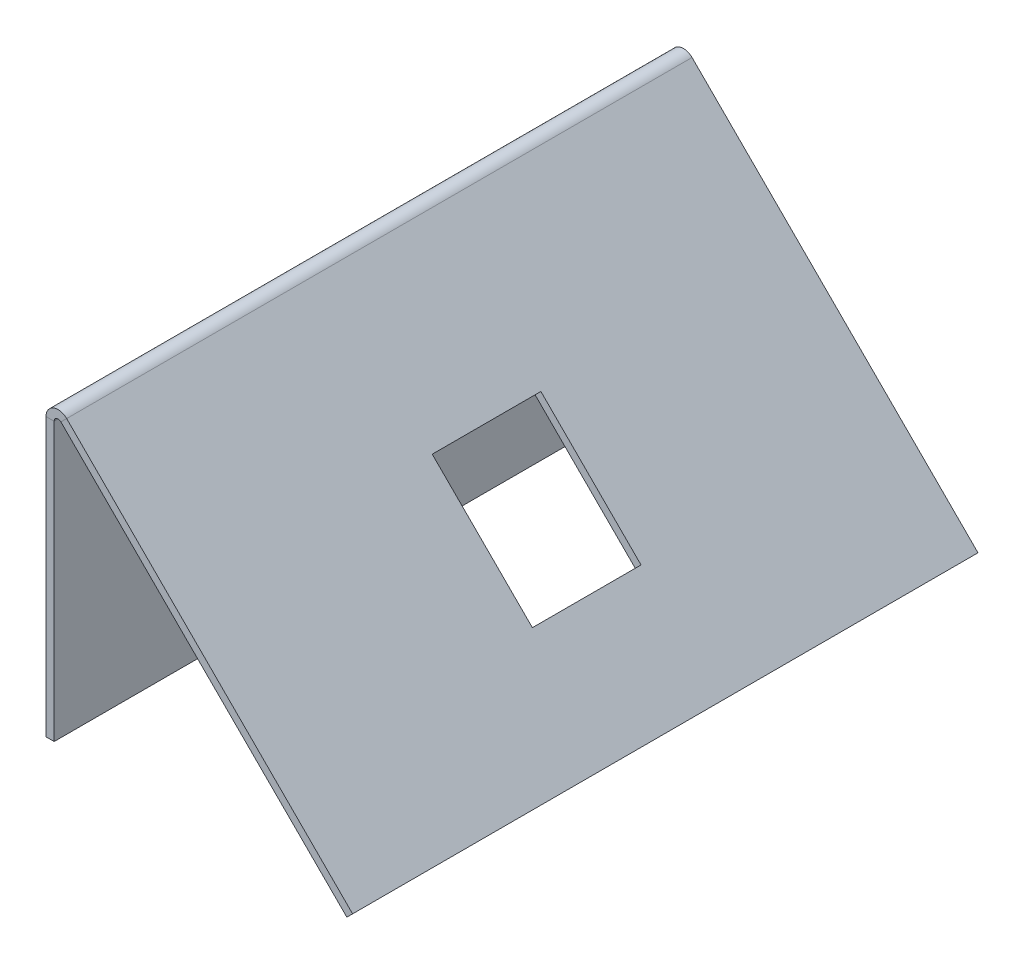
ISO-10303-21;
HEADER;
FILE_DESCRIPTION(('STEP AP214'),'2;1');
FILE_NAME('part.step','',(''),(''),'','','');
FILE_SCHEMA(('AUTOMOTIVE_DESIGN { 1 0 10303 214 1 1 1 1 }'));
ENDSEC;
DATA;
#1=APPLICATION_CONTEXT('core data for automotive mechanical design processes');
#2=APPLICATION_PROTOCOL_DEFINITION('international standard','automotive_design',2000,#1);
#3=PRODUCT_CONTEXT('',#1,'mechanical');
#4=PRODUCT('Part','Part','',(#3));
#5=PRODUCT_RELATED_PRODUCT_CATEGORY('part','',(#4));
#6=PRODUCT_DEFINITION_FORMATION('','',#4);
#7=PRODUCT_DEFINITION_CONTEXT('part definition',#1,'design');
#8=PRODUCT_DEFINITION('design','',#6,#7);
#9=PRODUCT_DEFINITION_SHAPE('','',#8);
#10=(LENGTH_UNIT() NAMED_UNIT(*) SI_UNIT(.MILLI.,.METRE.));
#11=(NAMED_UNIT(*) PLANE_ANGLE_UNIT() SI_UNIT($,.RADIAN.));
#12=(NAMED_UNIT(*) SI_UNIT($,.STERADIAN.) SOLID_ANGLE_UNIT());
#13=UNCERTAINTY_MEASURE_WITH_UNIT(LENGTH_MEASURE(1.E-05),#10,'distance_accuracy_value','');
#14=(GEOMETRIC_REPRESENTATION_CONTEXT(3) GLOBAL_UNCERTAINTY_ASSIGNED_CONTEXT((#13)) GLOBAL_UNIT_ASSIGNED_CONTEXT((#10,
#11,#12)) REPRESENTATION_CONTEXT('',''));
#15=CARTESIAN_POINT('',(0.,0.,0.));
#16=DIRECTION('',(0.,0.,1.));
#17=DIRECTION('',(1.,0.,0.));
#18=AXIS2_PLACEMENT_3D('',#15,#16,#17);
#19=CARTESIAN_POINT('',(-1.0776307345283,56.2074154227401,-116.84));
#20=DIRECTION('',(-0.707106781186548,-0.707106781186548,0.));
#21=DIRECTION('',(0.707106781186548,-0.707106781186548,0.));
#22=AXIS2_PLACEMENT_3D('',#19,#20,#21);
#23=PLANE('',#22);
#24=DIRECTION('',(0.707106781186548,-0.707106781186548,0.));
#25=VECTOR('',#24,1.);
#26=CARTESIAN_POINT('',(-1.0776307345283,56.2074154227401,0.));
#27=LINE('',#26,#25);
#28=CARTESIAN_POINT('',(2.78145485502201,52.3483298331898,0.));
#29=VERTEX_POINT('',#28);
#30=CARTESIAN_POINT('',(56.2074154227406,-1.0776307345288,0.));
#31=VERTEX_POINT('',#30);
#32=EDGE_CURVE('E215',#29,#31,#27,.T.);
#33=ORIENTED_EDGE('',*,*,#32,.F.);
#34=DIRECTION('',(0.,0.,1.));
#35=VECTOR('',#34,1.);
#36=CARTESIAN_POINT('',(2.78145485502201,52.3483298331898,-116.84));
#37=LINE('',#36,#35);
#38=CARTESIAN_POINT('',(2.78145485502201,52.3483298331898,-116.84));
#39=VERTEX_POINT('',#38);
#40=EDGE_CURVE('E261',#39,#29,#37,.T.);
#41=ORIENTED_EDGE('',*,*,#40,.F.);
#42=DIRECTION('',(0.707106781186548,-0.707106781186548,0.));
#43=VECTOR('',#42,1.);
#44=CARTESIAN_POINT('',(-1.0776307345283,56.2074154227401,-116.84));
#45=LINE('',#44,#43);
#46=CARTESIAN_POINT('',(56.2074154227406,-1.0776307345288,-116.84));
#47=VERTEX_POINT('',#46);
#48=EDGE_CURVE('E239',#39,#47,#45,.T.);
#49=ORIENTED_EDGE('',*,*,#48,.T.);
#50=DIRECTION('',(0.,0.,1.));
#51=VECTOR('',#50,1.);
#52=CARTESIAN_POINT('',(56.2074154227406,-1.0776307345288,-116.84));
#53=LINE('',#52,#51);
#54=EDGE_CURVE('E260',#47,#31,#53,.T.);
#55=ORIENTED_EDGE('',*,*,#54,.T.);
#56=EDGE_LOOP('',(#33,#41,#49,#55));
#57=FACE_BOUND('',#56,.T.);
#58=DIRECTION('',(0.,0.,-1.));
#59=VECTOR('',#58,1.);
#60=CARTESIAN_POINT('',(22.7395936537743,32.3901910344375,-116.84));
#61=LINE('',#60,#59);
#62=CARTESIAN_POINT('',(22.7395936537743,32.3901910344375,-48.3420996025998));
#63=VERTEX_POINT('',#62);
#64=CARTESIAN_POINT('',(22.7395936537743,32.3901910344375,-68.6406378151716));
#65=VERTEX_POINT('',#64);
#66=EDGE_CURVE('E172',#63,#65,#61,.T.);
#67=ORIENTED_EDGE('',*,*,#66,.F.);
#68=DIRECTION('',(-0.707106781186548,0.707106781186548,0.));
#69=VECTOR('',#68,1.);
#70=CARTESIAN_POINT('',(-1.0776307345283,56.2074154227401,-48.3420996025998));
#71=LINE('',#70,#69);
#72=CARTESIAN_POINT('',(41.45104501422,13.6787396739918,-48.3420996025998));
#73=VERTEX_POINT('',#72);
#74=EDGE_CURVE('E175',#73,#63,#71,.T.);
#75=ORIENTED_EDGE('',*,*,#74,.F.);
#76=DIRECTION('',(0.,0.,1.));
#77=VECTOR('',#76,1.);
#78=CARTESIAN_POINT('',(41.45104501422,13.6787396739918,-116.84));
#79=LINE('',#78,#77);
#80=CARTESIAN_POINT('',(41.45104501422,13.6787396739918,-68.6406378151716));
#81=VERTEX_POINT('',#80);
#82=EDGE_CURVE('E157',#81,#73,#79,.T.);
#83=ORIENTED_EDGE('',*,*,#82,.F.);
#84=DIRECTION('',(0.707106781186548,-0.707106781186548,0.));
#85=VECTOR('',#84,1.);
#86=CARTESIAN_POINT('',(-1.0776307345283,56.2074154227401,-68.6406378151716));
#87=LINE('',#86,#85);
#88=EDGE_CURVE('E165',#65,#81,#87,.T.);
#89=ORIENTED_EDGE('',*,*,#88,.F.);
#90=EDGE_LOOP('',(#67,#75,#83,#89));
#91=FACE_BOUND('',#90,.T.);
#92=ADVANCED_FACE('F43',(#57,#91),#23,.T.);
#93=CARTESIAN_POINT('',(0.,57.2850461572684,-116.84));
#94=DIRECTION('',(-0.707106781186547,-0.707106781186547,0.));
#95=DIRECTION('',(0.707106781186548,-0.707106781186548,0.));
#96=AXIS2_PLACEMENT_3D('',#93,#94,#95);
#97=PLANE('',#96);
#98=DIRECTION('',(0.707106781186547,-0.707106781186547,0.));
#99=VECTOR('',#98,1.);
#100=CARTESIAN_POINT('',(0.,57.2850461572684,0.));
#101=LINE('',#100,#99);
#102=CARTESIAN_POINT('',(3.85908558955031,53.4259605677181,0.));
#103=VERTEX_POINT('',#102);
#104=CARTESIAN_POINT('',(57.2850461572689,-5.00358550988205E-13,0.));
#105=VERTEX_POINT('',#104);
#106=EDGE_CURVE('E223',#103,#105,#101,.T.);
#107=ORIENTED_EDGE('',*,*,#106,.T.);
#108=DIRECTION('',(0.,0.,1.));
#109=VECTOR('',#108,1.);
#110=CARTESIAN_POINT('',(57.2850461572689,-5.00358550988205E-13,-116.84));
#111=LINE('',#110,#109);
#112=CARTESIAN_POINT('',(57.2850461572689,-5.00358550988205E-13,-116.84));
#113=VERTEX_POINT('',#112);
#114=EDGE_CURVE('E279',#113,#105,#111,.T.);
#115=ORIENTED_EDGE('',*,*,#114,.F.);
#116=DIRECTION('',(0.707106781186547,-0.707106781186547,0.));
#117=VECTOR('',#116,1.);
#118=CARTESIAN_POINT('',(0.,57.2850461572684,-116.84));
#119=LINE('',#118,#117);
#120=CARTESIAN_POINT('',(3.85908558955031,53.4259605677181,-116.84));
#121=VERTEX_POINT('',#120);
#122=EDGE_CURVE('E244',#121,#113,#119,.T.);
#123=ORIENTED_EDGE('',*,*,#122,.F.);
#124=DIRECTION('',(0.,0.,1.));
#125=VECTOR('',#124,1.);
#126=CARTESIAN_POINT('',(3.85908558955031,53.4259605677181,-116.84));
#127=LINE('',#126,#125);
#128=EDGE_CURVE('E276',#121,#103,#127,.T.);
#129=ORIENTED_EDGE('',*,*,#128,.T.);
#130=EDGE_LOOP('',(#107,#115,#123,#129));
#131=FACE_BOUND('',#130,.T.);
#132=DIRECTION('',(0.707106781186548,-0.707106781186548,0.));
#133=VECTOR('',#132,1.);
#134=CARTESIAN_POINT('',(0.,57.2850461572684,-48.3420996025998));
#135=LINE('',#134,#133);
#136=CARTESIAN_POINT('',(42.5286757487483,14.7563704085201,-48.3420996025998));
#137=VERTEX_POINT('',#136);
#138=CARTESIAN_POINT('',(23.8172243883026,33.4678217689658,-48.3420996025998));
#139=VERTEX_POINT('',#138);
#140=EDGE_CURVE('E171',#137,#139,#135,.F.);
#141=ORIENTED_EDGE('',*,*,#140,.T.);
#142=DIRECTION('',(0.,0.,1.));
#143=VECTOR('',#142,1.);
#144=CARTESIAN_POINT('',(23.8172243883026,33.4678217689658,-116.84));
#145=LINE('',#144,#143);
#146=CARTESIAN_POINT('',(23.8172243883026,33.4678217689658,-68.6406378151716));
#147=VERTEX_POINT('',#146);
#148=EDGE_CURVE('E170',#139,#147,#145,.F.);
#149=ORIENTED_EDGE('',*,*,#148,.T.);
#150=DIRECTION('',(0.707106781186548,-0.707106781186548,0.));
#151=VECTOR('',#150,1.);
#152=CARTESIAN_POINT('',(0.,57.2850461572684,-68.6406378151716));
#153=LINE('',#152,#151);
#154=CARTESIAN_POINT('',(42.5286757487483,14.7563704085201,-68.6406378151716));
#155=VERTEX_POINT('',#154);
#156=EDGE_CURVE('E162',#147,#155,#153,.T.);
#157=ORIENTED_EDGE('',*,*,#156,.T.);
#158=DIRECTION('',(0.,0.,1.));
#159=VECTOR('',#158,1.);
#160=CARTESIAN_POINT('',(42.5286757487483,14.7563704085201,-116.84));
#161=LINE('',#160,#159);
#162=EDGE_CURVE('E152',#155,#137,#161,.T.);
#163=ORIENTED_EDGE('',*,*,#162,.T.);
#164=EDGE_LOOP('',(#141,#149,#157,#163));
#165=FACE_BOUND('',#164,.T.);
#166=ADVANCED_FACE('F169',(#131,#165),#97,.F.);
#167=CARTESIAN_POINT('',(1.524,0.,-116.84));
#168=DIRECTION('',(1.,0.,0.));
#169=DIRECTION('',(0.,0.,-1.));
#170=AXIS2_PLACEMENT_3D('',#167,#168,#169);
#171=PLANE('',#170);
#172=DIRECTION('',(0.,1.,0.));
#173=VECTOR('',#172,1.);
#174=CARTESIAN_POINT('',(1.524,0.,0.));
#175=LINE('',#174,#173);
#176=CARTESIAN_POINT('',(1.524,0.,0.));
#177=VERTEX_POINT('',#176);
#178=CARTESIAN_POINT('',(1.524,51.8274749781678,0.));
#179=VERTEX_POINT('',#178);
#180=EDGE_CURVE('E233',#177,#179,#175,.T.);
#181=ORIENTED_EDGE('',*,*,#180,.F.);
#182=DIRECTION('',(0.,0.,1.));
#183=VECTOR('',#182,1.);
#184=CARTESIAN_POINT('',(1.524,0.,-116.84));
#185=LINE('',#184,#183);
#186=CARTESIAN_POINT('',(1.524,0.,-116.84));
#187=VERTEX_POINT('',#186);
#188=EDGE_CURVE('E268',#187,#177,#185,.T.);
#189=ORIENTED_EDGE('',*,*,#188,.F.);
#190=DIRECTION('',(0.,1.,0.));
#191=VECTOR('',#190,1.);
#192=CARTESIAN_POINT('',(1.524,0.,-116.84));
#193=LINE('',#192,#191);
#194=CARTESIAN_POINT('',(1.524,51.8274749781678,-116.84));
#195=VERTEX_POINT('',#194);
#196=EDGE_CURVE('E254',#187,#195,#193,.T.);
#197=ORIENTED_EDGE('',*,*,#196,.T.);
#198=DIRECTION('',(0.,0.,1.));
#199=VECTOR('',#198,1.);
#200=CARTESIAN_POINT('',(1.524,51.8274749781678,-116.84));
#201=LINE('',#200,#199);
#202=EDGE_CURVE('E265',#195,#179,#201,.T.);
#203=ORIENTED_EDGE('',*,*,#202,.T.);
#204=EDGE_LOOP('',(#181,#189,#197,#203));
#205=FACE_BOUND('',#204,.T.);
#206=DIRECTION('',(0.,-1.,0.));
#207=VECTOR('',#206,1.);
#208=CARTESIAN_POINT('',(1.524,0.,-48.3420996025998));
#209=LINE('',#208,#207);
#210=CARTESIAN_POINT('',(1.524,32.3901910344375,-48.3420996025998));
#211=VERTEX_POINT('',#210);
#212=CARTESIAN_POINT('',(1.524,14.7563704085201,-48.3420996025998));
#213=VERTEX_POINT('',#212);
#214=EDGE_CURVE('E192',#211,#213,#209,.T.);
#215=ORIENTED_EDGE('',*,*,#214,.F.);
#216=DIRECTION('',(0.,0.,1.));
#217=VECTOR('',#216,1.);
#218=CARTESIAN_POINT('',(1.524,32.3901910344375,-116.84));
#219=LINE('',#218,#217);
#220=CARTESIAN_POINT('',(1.524,32.3901910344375,-68.6406378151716));
#221=VERTEX_POINT('',#220);
#222=EDGE_CURVE('E190',#221,#211,#219,.T.);
#223=ORIENTED_EDGE('',*,*,#222,.F.);
#224=DIRECTION('',(0.,1.,0.));
#225=VECTOR('',#224,1.);
#226=CARTESIAN_POINT('',(1.524,0.,-68.6406378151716));
#227=LINE('',#226,#225);
#228=CARTESIAN_POINT('',(1.524,14.7563704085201,-68.6406378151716));
#229=VERTEX_POINT('',#228);
#230=EDGE_CURVE('E188',#229,#221,#227,.T.);
#231=ORIENTED_EDGE('',*,*,#230,.F.);
#232=DIRECTION('',(0.,0.,-1.));
#233=VECTOR('',#232,1.);
#234=CARTESIAN_POINT('',(1.524,14.7563704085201,-116.84));
#235=LINE('',#234,#233);
#236=EDGE_CURVE('E185',#213,#229,#235,.T.);
#237=ORIENTED_EDGE('',*,*,#236,.F.);
#238=EDGE_LOOP('',(#215,#223,#231,#237));
#239=FACE_BOUND('',#238,.T.);
#240=ADVANCED_FACE('F315',(#205,#239),#171,.T.);
#241=CARTESIAN_POINT('',(0.,0.,-116.84));
#242=DIRECTION('',(1.,0.,0.));
#243=DIRECTION('',(0.,0.,-1.));
#244=AXIS2_PLACEMENT_3D('',#241,#242,#243);
#245=PLANE('',#244);
#246=DIRECTION('',(0.,1.,0.));
#247=VECTOR('',#246,1.);
#248=CARTESIAN_POINT('',(0.,0.,0.));
#249=LINE('',#248,#247);
#250=CARTESIAN_POINT('',(0.,0.,0.));
#251=VERTEX_POINT('',#250);
#252=CARTESIAN_POINT('',(0.,51.8274749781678,0.));
#253=VERTEX_POINT('',#252);
#254=EDGE_CURVE('E228',#251,#253,#249,.T.);
#255=ORIENTED_EDGE('',*,*,#254,.T.);
#256=DIRECTION('',(0.,0.,1.));
#257=VECTOR('',#256,1.);
#258=CARTESIAN_POINT('',(0.,51.8274749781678,-116.84));
#259=LINE('',#258,#257);
#260=CARTESIAN_POINT('',(0.,51.8274749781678,-116.84));
#261=VERTEX_POINT('',#260);
#262=EDGE_CURVE('E273',#261,#253,#259,.T.);
#263=ORIENTED_EDGE('',*,*,#262,.F.);
#264=DIRECTION('',(0.,1.,0.));
#265=VECTOR('',#264,1.);
#266=CARTESIAN_POINT('',(0.,0.,-116.84));
#267=LINE('',#266,#265);
#268=CARTESIAN_POINT('',(0.,0.,-116.84));
#269=VERTEX_POINT('',#268);
#270=EDGE_CURVE('E249',#269,#261,#267,.T.);
#271=ORIENTED_EDGE('',*,*,#270,.F.);
#272=DIRECTION('',(0.,0.,1.));
#273=VECTOR('',#272,1.);
#274=CARTESIAN_POINT('',(0.,0.,-116.84));
#275=LINE('',#274,#273);
#276=EDGE_CURVE('E270',#269,#251,#275,.T.);
#277=ORIENTED_EDGE('',*,*,#276,.T.);
#278=EDGE_LOOP('',(#255,#263,#271,#277));
#279=FACE_BOUND('',#278,.T.);
#280=DIRECTION('',(0.,0.,-1.));
#281=VECTOR('',#280,1.);
#282=CARTESIAN_POINT('',(0.,32.3901910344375,-116.84));
#283=LINE('',#282,#281);
#284=CARTESIAN_POINT('',(0.,32.3901910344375,-68.6406378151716));
#285=VERTEX_POINT('',#284);
#286=CARTESIAN_POINT('',(0.,32.3901910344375,-48.3420996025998));
#287=VERTEX_POINT('',#286);
#288=EDGE_CURVE('E202',#285,#287,#283,.F.);
#289=ORIENTED_EDGE('',*,*,#288,.T.);
#290=DIRECTION('',(0.,1.,0.));
#291=VECTOR('',#290,1.);
#292=CARTESIAN_POINT('',(0.,0.,-48.3420996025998));
#293=LINE('',#292,#291);
#294=CARTESIAN_POINT('',(0.,14.7563704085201,-48.3420996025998));
#295=VERTEX_POINT('',#294);
#296=EDGE_CURVE('E198',#287,#295,#293,.F.);
#297=ORIENTED_EDGE('',*,*,#296,.T.);
#298=DIRECTION('',(0.,0.,-1.));
#299=VECTOR('',#298,1.);
#300=CARTESIAN_POINT('',(0.,14.7563704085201,-116.84));
#301=LINE('',#300,#299);
#302=CARTESIAN_POINT('',(0.,14.7563704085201,-68.6406378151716));
#303=VERTEX_POINT('',#302);
#304=EDGE_CURVE('E194',#295,#303,#301,.T.);
#305=ORIENTED_EDGE('',*,*,#304,.T.);
#306=DIRECTION('',(0.,1.,0.));
#307=VECTOR('',#306,1.);
#308=CARTESIAN_POINT('',(0.,0.,-68.6406378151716));
#309=LINE('',#308,#307);
#310=EDGE_CURVE('E197',#303,#285,#309,.T.);
#311=ORIENTED_EDGE('',*,*,#310,.T.);
#312=EDGE_LOOP('',(#289,#297,#305,#311));
#313=FACE_BOUND('',#312,.T.);
#314=ADVANCED_FACE('F324',(#279,#313),#245,.F.);
#315=CARTESIAN_POINT('',(0.,51.8274749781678,-116.84));
#316=DIRECTION('',(0.,0.,-1.));
#317=DIRECTION('',(-1.,0.,0.));
#318=AXIS2_PLACEMENT_3D('',#315,#316,#317);
#319=PLANE('',#318);
#320=DIRECTION('',(1.,0.,0.));
#321=VECTOR('',#320,1.);
#322=CARTESIAN_POINT('',(0.,51.8274749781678,-116.84));
#323=LINE('',#322,#321);
#324=EDGE_CURVE('E11',#261,#195,#323,.T.);
#325=ORIENTED_EDGE('',*,*,#324,.F.);
#326=CARTESIAN_POINT('',(2.2606,51.8274749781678,-116.84));
#327=DIRECTION('',(0.,0.,1.));
#328=DIRECTION('',(1.,0.,0.));
#329=AXIS2_PLACEMENT_3D('',#326,#327,#328);
#330=CIRCLE('',#329,2.2606);
#331=EDGE_CURVE('E246',#261,#121,#330,.F.);
#332=ORIENTED_EDGE('',*,*,#331,.T.);
#333=DIRECTION('',(0.707106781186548,0.707106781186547,0.));
#334=VECTOR('',#333,1.);
#335=CARTESIAN_POINT('',(2.78145485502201,52.3483298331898,-116.84));
#336=LINE('',#335,#334);
#337=EDGE_CURVE('E51',#39,#121,#336,.T.);
#338=ORIENTED_EDGE('',*,*,#337,.F.);
#339=CARTESIAN_POINT('',(2.2606,51.8274749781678,-116.84));
#340=DIRECTION('',(0.,0.,1.));
#341=DIRECTION('',(1.,0.,0.));
#342=AXIS2_PLACEMENT_3D('',#339,#340,#341);
#343=CIRCLE('',#342,0.7366);
#344=EDGE_CURVE('E257',#195,#39,#343,.F.);
#345=ORIENTED_EDGE('',*,*,#344,.F.);
#346=EDGE_LOOP('',(#325,#332,#338,#345));
#347=FACE_BOUND('',#346,.T.);
#348=ADVANCED_FACE('F45',(#347),#319,.T.);
#349=CARTESIAN_POINT('',(2.78145485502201,52.3483298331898,-116.84));
#350=DIRECTION('',(0.,0.,-1.));
#351=DIRECTION('',(-1.,0.,0.));
#352=AXIS2_PLACEMENT_3D('',#349,#350,#351);
#353=PLANE('',#352);
#354=ORIENTED_EDGE('',*,*,#270,.T.);
#355=ORIENTED_EDGE('',*,*,#324,.T.);
#356=ORIENTED_EDGE('',*,*,#196,.F.);
#357=DIRECTION('',(-1.,0.,0.));
#358=VECTOR('',#357,1.);
#359=CARTESIAN_POINT('',(1.524,0.,-116.84));
#360=LINE('',#359,#358);
#361=EDGE_CURVE('E252',#187,#269,#360,.T.);
#362=ORIENTED_EDGE('',*,*,#361,.T.);
#363=EDGE_LOOP('',(#354,#355,#356,#362));
#364=FACE_BOUND('',#363,.T.);
#365=ADVANCED_FACE('F319',(#364),#353,.T.);
#366=CARTESIAN_POINT('',(3.85908558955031,53.4259605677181,0.));
#367=DIRECTION('',(0.,0.,1.));
#368=DIRECTION('',(1.,0.,0.));
#369=AXIS2_PLACEMENT_3D('',#366,#367,#368);
#370=PLANE('',#369);
#371=DIRECTION('',(-0.707106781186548,-0.707106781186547,0.));
#372=VECTOR('',#371,1.);
#373=CARTESIAN_POINT('',(3.85908558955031,53.4259605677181,0.));
#374=LINE('',#373,#372);
#375=EDGE_CURVE('E284',#103,#29,#374,.T.);
#376=ORIENTED_EDGE('',*,*,#375,.F.);
#377=CARTESIAN_POINT('',(2.2606,51.8274749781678,0.));
#378=DIRECTION('',(0.,0.,1.));
#379=DIRECTION('',(1.,0.,0.));
#380=AXIS2_PLACEMENT_3D('',#377,#378,#379);
#381=CIRCLE('',#380,2.2606);
#382=EDGE_CURVE('E225',#253,#103,#381,.F.);
#383=ORIENTED_EDGE('',*,*,#382,.F.);
#384=DIRECTION('',(-1.,0.,0.));
#385=VECTOR('',#384,1.);
#386=CARTESIAN_POINT('',(1.524,51.8274749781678,0.));
#387=LINE('',#386,#385);
#388=EDGE_CURVE('E264',#179,#253,#387,.T.);
#389=ORIENTED_EDGE('',*,*,#388,.F.);
#390=CARTESIAN_POINT('',(2.2606,51.8274749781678,0.));
#391=DIRECTION('',(0.,0.,1.));
#392=DIRECTION('',(1.,0.,0.));
#393=AXIS2_PLACEMENT_3D('',#390,#391,#392);
#394=CIRCLE('',#393,0.7366);
#395=EDGE_CURVE('E236',#179,#29,#394,.F.);
#396=ORIENTED_EDGE('',*,*,#395,.T.);
#397=EDGE_LOOP('',(#376,#383,#389,#396));
#398=FACE_BOUND('',#397,.T.);
#399=ADVANCED_FACE('F328',(#398),#370,.T.);
#400=CARTESIAN_POINT('',(1.524,51.8274749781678,0.));
#401=DIRECTION('',(0.,0.,1.));
#402=DIRECTION('',(1.,0.,0.));
#403=AXIS2_PLACEMENT_3D('',#400,#401,#402);
#404=PLANE('',#403);
#405=ORIENTED_EDGE('',*,*,#106,.F.);
#406=ORIENTED_EDGE('',*,*,#375,.T.);
#407=ORIENTED_EDGE('',*,*,#32,.T.);
#408=DIRECTION('',(-0.707106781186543,-0.707106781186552,0.));
#409=VECTOR('',#408,1.);
#410=CARTESIAN_POINT('',(57.2850461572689,-5.00358550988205E-13,0.));
#411=LINE('',#410,#409);
#412=EDGE_CURVE('E220',#105,#31,#411,.T.);
#413=ORIENTED_EDGE('',*,*,#412,.F.);
#414=EDGE_LOOP('',(#405,#406,#407,#413));
#415=FACE_BOUND('',#414,.T.);
#416=ADVANCED_FACE('F330',(#415),#404,.T.);
#417=CARTESIAN_POINT('',(2.2606,51.8274749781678,-116.84));
#418=DIRECTION('',(0.,0.,1.));
#419=DIRECTION('',(1.,0.,0.));
#420=AXIS2_PLACEMENT_3D('',#417,#418,#419);
#421=CYLINDRICAL_SURFACE('',#420,0.7366);
#422=ORIENTED_EDGE('',*,*,#395,.F.);
#423=ORIENTED_EDGE('',*,*,#202,.F.);
#424=ORIENTED_EDGE('',*,*,#344,.T.);
#425=ORIENTED_EDGE('',*,*,#40,.T.);
#426=EDGE_LOOP('',(#422,#423,#424,#425));
#427=FACE_BOUND('',#426,.T.);
#428=ADVANCED_FACE('F310',(#427),#421,.F.);
#429=CARTESIAN_POINT('',(1.524,0.,-116.84));
#430=DIRECTION('',(0.,1.,0.));
#431=DIRECTION('',(0.,0.,1.));
#432=AXIS2_PLACEMENT_3D('',#429,#430,#431);
#433=PLANE('',#432);
#434=DIRECTION('',(-1.,0.,0.));
#435=VECTOR('',#434,1.);
#436=CARTESIAN_POINT('',(1.524,0.,0.));
#437=LINE('',#436,#435);
#438=EDGE_CURVE('E231',#177,#251,#437,.T.);
#439=ORIENTED_EDGE('',*,*,#438,.T.);
#440=ORIENTED_EDGE('',*,*,#276,.F.);
#441=ORIENTED_EDGE('',*,*,#361,.F.);
#442=ORIENTED_EDGE('',*,*,#188,.T.);
#443=EDGE_LOOP('',(#439,#440,#441,#442));
#444=FACE_BOUND('',#443,.T.);
#445=ADVANCED_FACE('F337',(#444),#433,.F.);
#446=CARTESIAN_POINT('',(2.2606,51.8274749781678,-116.84));
#447=DIRECTION('',(0.,0.,1.));
#448=DIRECTION('',(1.,0.,0.));
#449=AXIS2_PLACEMENT_3D('',#446,#447,#448);
#450=CYLINDRICAL_SURFACE('',#449,2.2606);
#451=ORIENTED_EDGE('',*,*,#382,.T.);
#452=ORIENTED_EDGE('',*,*,#128,.F.);
#453=ORIENTED_EDGE('',*,*,#331,.F.);
#454=ORIENTED_EDGE('',*,*,#262,.T.);
#455=EDGE_LOOP('',(#451,#452,#453,#454));
#456=FACE_BOUND('',#455,.T.);
#457=ADVANCED_FACE('F296',(#456),#450,.T.);
#458=CARTESIAN_POINT('',(57.2850461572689,-5.00358550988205E-13,-116.84));
#459=DIRECTION('',(-0.707106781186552,0.707106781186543,0.));
#460=DIRECTION('',(-0.707106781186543,-0.707106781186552,0.));
#461=AXIS2_PLACEMENT_3D('',#458,#459,#460);
#462=PLANE('',#461);
#463=ORIENTED_EDGE('',*,*,#412,.T.);
#464=ORIENTED_EDGE('',*,*,#54,.F.);
#465=DIRECTION('',(-0.707106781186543,-0.707106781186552,0.));
#466=VECTOR('',#465,1.);
#467=CARTESIAN_POINT('',(57.2850461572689,-5.00358550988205E-13,-116.84));
#468=LINE('',#467,#466);
#469=EDGE_CURVE('E242',#113,#47,#468,.T.);
#470=ORIENTED_EDGE('',*,*,#469,.F.);
#471=ORIENTED_EDGE('',*,*,#114,.T.);
#472=EDGE_LOOP('',(#463,#464,#470,#471));
#473=FACE_BOUND('',#472,.T.);
#474=ADVANCED_FACE('F304',(#473),#462,.F.);
#475=CARTESIAN_POINT('',(2.2606,51.8274749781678,-116.84));
#476=DIRECTION('',(0.,0.,1.));
#477=DIRECTION('',(1.,0.,0.));
#478=AXIS2_PLACEMENT_3D('',#475,#476,#477);
#479=PLANE('',#478);
#480=ORIENTED_EDGE('',*,*,#48,.F.);
#481=ORIENTED_EDGE('',*,*,#337,.T.);
#482=ORIENTED_EDGE('',*,*,#122,.T.);
#483=ORIENTED_EDGE('',*,*,#469,.T.);
#484=EDGE_LOOP('',(#480,#481,#482,#483));
#485=FACE_BOUND('',#484,.T.);
#486=ADVANCED_FACE('F287',(#485),#479,.F.);
#487=CARTESIAN_POINT('',(2.2606,51.8274749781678,0.));
#488=DIRECTION('',(0.,0.,1.));
#489=DIRECTION('',(1.,0.,0.));
#490=AXIS2_PLACEMENT_3D('',#487,#488,#489);
#491=PLANE('',#490);
#492=ORIENTED_EDGE('',*,*,#180,.T.);
#493=ORIENTED_EDGE('',*,*,#388,.T.);
#494=ORIENTED_EDGE('',*,*,#254,.F.);
#495=ORIENTED_EDGE('',*,*,#438,.F.);
#496=EDGE_LOOP('',(#492,#493,#494,#495));
#497=FACE_BOUND('',#496,.T.);
#498=ADVANCED_FACE('F361',(#497),#491,.T.);
#499=CARTESIAN_POINT('',(1.524,32.3901910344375,-116.84));
#500=DIRECTION('',(0.,1.,0.));
#501=DIRECTION('',(0.,0.,1.));
#502=AXIS2_PLACEMENT_3D('',#499,#500,#501);
#503=PLANE('',#502);
#504=DIRECTION('',(1.,0.,0.));
#505=VECTOR('',#504,1.);
#506=CARTESIAN_POINT('',(1.524,32.3901910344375,-68.6406378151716));
#507=LINE('',#506,#505);
#508=EDGE_CURVE('E213',#221,#285,#507,.F.);
#509=ORIENTED_EDGE('',*,*,#508,.F.);
#510=ORIENTED_EDGE('',*,*,#222,.T.);
#511=DIRECTION('',(1.,0.,0.));
#512=VECTOR('',#511,1.);
#513=CARTESIAN_POINT('',(1.524,32.3901910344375,-48.3420996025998));
#514=LINE('',#513,#512);
#515=EDGE_CURVE('E210',#211,#287,#514,.F.);
#516=ORIENTED_EDGE('',*,*,#515,.T.);
#517=ORIENTED_EDGE('',*,*,#288,.F.);
#518=EDGE_LOOP('',(#509,#510,#516,#517));
#519=FACE_BOUND('',#518,.T.);
#520=ADVANCED_FACE('F363',(#519),#503,.F.);
#521=CARTESIAN_POINT('',(1.524,0.,-48.3420996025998));
#522=DIRECTION('',(0.,0.,1.));
#523=DIRECTION('',(0.,-1.,0.));
#524=AXIS2_PLACEMENT_3D('',#521,#522,#523);
#525=PLANE('',#524);
#526=ORIENTED_EDGE('',*,*,#515,.F.);
#527=ORIENTED_EDGE('',*,*,#214,.T.);
#528=DIRECTION('',(1.,0.,0.));
#529=VECTOR('',#528,1.);
#530=CARTESIAN_POINT('',(1.524,14.7563704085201,-48.3420996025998));
#531=LINE('',#530,#529);
#532=EDGE_CURVE('E207',#213,#295,#531,.F.);
#533=ORIENTED_EDGE('',*,*,#532,.T.);
#534=ORIENTED_EDGE('',*,*,#296,.F.);
#535=EDGE_LOOP('',(#526,#527,#533,#534));
#536=FACE_BOUND('',#535,.T.);
#537=ADVANCED_FACE('F373',(#536),#525,.F.);
#538=CARTESIAN_POINT('',(1.524,14.7563704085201,-116.84));
#539=DIRECTION('',(0.,-1.,0.));
#540=DIRECTION('',(0.,0.,-1.));
#541=AXIS2_PLACEMENT_3D('',#538,#539,#540);
#542=PLANE('',#541);
#543=ORIENTED_EDGE('',*,*,#532,.F.);
#544=ORIENTED_EDGE('',*,*,#236,.T.);
#545=DIRECTION('',(1.,0.,0.));
#546=VECTOR('',#545,1.);
#547=CARTESIAN_POINT('',(1.524,14.7563704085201,-68.6406378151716));
#548=LINE('',#547,#546);
#549=EDGE_CURVE('E201',#229,#303,#548,.F.);
#550=ORIENTED_EDGE('',*,*,#549,.T.);
#551=ORIENTED_EDGE('',*,*,#304,.F.);
#552=EDGE_LOOP('',(#543,#544,#550,#551));
#553=FACE_BOUND('',#552,.T.);
#554=ADVANCED_FACE('F369',(#553),#542,.F.);
#555=CARTESIAN_POINT('',(1.524,0.,-68.6406378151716));
#556=DIRECTION('',(0.,0.,-1.));
#557=DIRECTION('',(0.,1.,0.));
#558=AXIS2_PLACEMENT_3D('',#555,#556,#557);
#559=PLANE('',#558);
#560=ORIENTED_EDGE('',*,*,#230,.T.);
#561=ORIENTED_EDGE('',*,*,#508,.T.);
#562=ORIENTED_EDGE('',*,*,#310,.F.);
#563=ORIENTED_EDGE('',*,*,#549,.F.);
#564=EDGE_LOOP('',(#560,#561,#562,#563));
#565=FACE_BOUND('',#564,.T.);
#566=ADVANCED_FACE('F365',(#565),#559,.F.);
#567=CARTESIAN_POINT('',(-1.0776307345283,56.2074154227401,-48.3420996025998));
#568=DIRECTION('',(0.,0.,1.));
#569=DIRECTION('',(-0.707106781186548,0.707106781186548,0.));
#570=AXIS2_PLACEMENT_3D('',#567,#568,#569);
#571=PLANE('',#570);
#572=ORIENTED_EDGE('',*,*,#140,.F.);
#573=DIRECTION('',(0.707106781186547,0.707106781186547,0.));
#574=VECTOR('',#573,1.);
#575=CARTESIAN_POINT('',(42.5286757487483,14.7563704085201,-48.3420996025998));
#576=LINE('',#575,#574);
#577=EDGE_CURVE('E63',#137,#73,#576,.F.);
#578=ORIENTED_EDGE('',*,*,#577,.T.);
#579=ORIENTED_EDGE('',*,*,#74,.T.);
#580=DIRECTION('',(-0.707106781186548,-0.707106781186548,0.));
#581=VECTOR('',#580,1.);
#582=CARTESIAN_POINT('',(22.7395936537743,32.3901910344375,-48.3420996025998));
#583=LINE('',#582,#581);
#584=EDGE_CURVE('E182',#63,#139,#583,.F.);
#585=ORIENTED_EDGE('',*,*,#584,.T.);
#586=EDGE_LOOP('',(#572,#578,#579,#585));
#587=FACE_BOUND('',#586,.T.);
#588=ADVANCED_FACE('F368',(#587),#571,.F.);
#589=CARTESIAN_POINT('',(22.7395936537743,32.3901910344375,-116.84));
#590=DIRECTION('',(-0.707106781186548,0.707106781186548,0.));
#591=DIRECTION('',(0.,0.,-1.));
#592=AXIS2_PLACEMENT_3D('',#589,#590,#591);
#593=PLANE('',#592);
#594=ORIENTED_EDGE('',*,*,#584,.F.);
#595=ORIENTED_EDGE('',*,*,#66,.T.);
#596=DIRECTION('',(-0.707106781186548,-0.707106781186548,0.));
#597=VECTOR('',#596,1.);
#598=CARTESIAN_POINT('',(22.7395936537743,32.3901910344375,-68.6406378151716));
#599=LINE('',#598,#597);
#600=EDGE_CURVE('E179',#65,#147,#599,.F.);
#601=ORIENTED_EDGE('',*,*,#600,.T.);
#602=ORIENTED_EDGE('',*,*,#148,.F.);
#603=EDGE_LOOP('',(#594,#595,#601,#602));
#604=FACE_BOUND('',#603,.T.);
#605=ADVANCED_FACE('F383',(#604),#593,.F.);
#606=CARTESIAN_POINT('',(-1.0776307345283,56.2074154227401,-68.6406378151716));
#607=DIRECTION('',(0.,0.,-1.));
#608=DIRECTION('',(0.707106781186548,-0.707106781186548,0.));
#609=AXIS2_PLACEMENT_3D('',#606,#607,#608);
#610=PLANE('',#609);
#611=DIRECTION('',(0.707106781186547,0.707106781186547,0.));
#612=VECTOR('',#611,1.);
#613=CARTESIAN_POINT('',(42.5286757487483,14.7563704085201,-68.6406378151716));
#614=LINE('',#613,#612);
#615=EDGE_CURVE('E58',#155,#81,#614,.F.);
#616=ORIENTED_EDGE('',*,*,#615,.F.);
#617=ORIENTED_EDGE('',*,*,#156,.F.);
#618=ORIENTED_EDGE('',*,*,#600,.F.);
#619=ORIENTED_EDGE('',*,*,#88,.T.);
#620=EDGE_LOOP('',(#616,#617,#618,#619));
#621=FACE_BOUND('',#620,.T.);
#622=ADVANCED_FACE('F160',(#621),#610,.F.);
#623=CARTESIAN_POINT('',(42.5286757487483,14.7563704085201,-116.84));
#624=DIRECTION('',(0.707106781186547,-0.707106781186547,0.));
#625=DIRECTION('',(0.,0.,1.));
#626=AXIS2_PLACEMENT_3D('',#623,#624,#625);
#627=PLANE('',#626);
#628=ORIENTED_EDGE('',*,*,#577,.F.);
#629=ORIENTED_EDGE('',*,*,#162,.F.);
#630=ORIENTED_EDGE('',*,*,#615,.T.);
#631=ORIENTED_EDGE('',*,*,#82,.T.);
#632=EDGE_LOOP('',(#628,#629,#630,#631));
#633=FACE_BOUND('',#632,.T.);
#634=ADVANCED_FACE('F153',(#633),#627,.F.);
#635=CLOSED_SHELL('',(#92,#166,#240,#314,#348,#365,#399,#416,#428,#445,#457,#474,#486,#498,#520,
#537,#554,#566,#588,#605,#622,#634));
#636=MANIFOLD_SOLID_BREP('B2',#635);
#637=ADVANCED_BREP_SHAPE_REPRESENTATION('',(#18,#636),#14);
#638=SHAPE_DEFINITION_REPRESENTATION(#9,#637);
ENDSEC;
END-ISO-10303-21;
